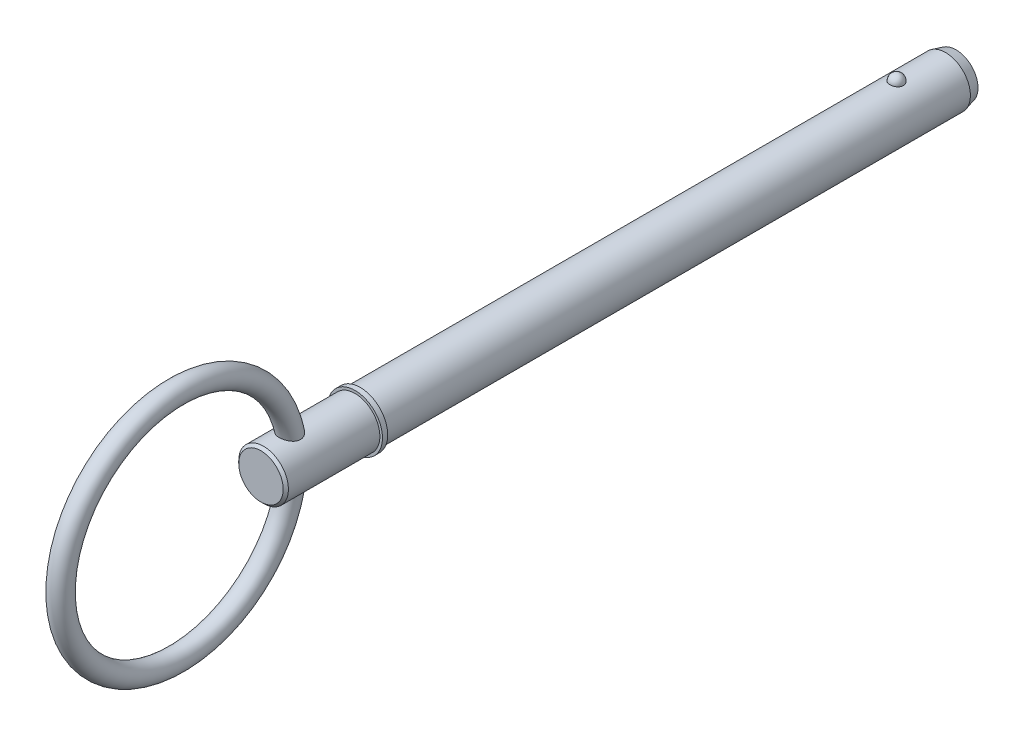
from build123d import *

# Parameters (mm, degrees)
SKETCH2_R           = 4.765
BOSS_EXTRUDE1_DEPTH = 101.6
BOSS_EXTRUDE2_START = 12.7
SKETCH3_R           = 4.765
BOSS_EXTRUDE2_DEPTH = 12.7
CHAMFER1_SIZE       = 2
CHAMFER1_SIZE2      = 0.535898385
SKETCH20_W          = 1
SKETCH20_H          = 5.265
SKETCH21_R          = 4.765
BOSS_EXTRUDE3_DEPTH = 19.05
CHAMFER2_SIZE       = 0.5
SKETCH24_R          = 2


with BuildPart() as part:
    # Sketch2 → Boss-Extrude1 (new body)
    with BuildSketch(Plane.XY):
        Circle(SKETCH2_R)
    extrude(amount=BOSS_EXTRUDE1_DEPTH)

    # Sketch3 → Boss-Extrude2 (add)
    with BuildSketch(Plane(origin=(0, 0, 0), x_dir=(-1, 0, 0), z_dir=(0, 0, -1)).offset(BOSS_EXTRUDE2_START)):
        Circle(SKETCH3_R)
    extrude(amount=-BOSS_EXTRUDE2_DEPTH)

    # Chamfer1
    chamfer1_edges = [part.edges().sort_by_distance(p)[0] for p in [
        (4.765, 0, -12.7),
    ]]
    chamfer1_side = [part.faces().sort_by_distance(p)[0] for p in [
        (4.765, 0, -6.35),
    ]]
    chamfer(chamfer1_edges, length=CHAMFER1_SIZE, length2=CHAMFER1_SIZE2, reference=chamfer1_side[0])

    # Sketch18 → Revolve1 (revolve)
    with BuildSketch(Plane(origin=(0, 0, 0), x_dir=(0, 0, -1), z_dir=(1, 0, 0))):
        with BuildLine():
            Line((1.29, 6.055), (1.29, 3.475))
            ThreePointArc((1.29, 3.475), (0, 4.765), (1.29, 6.055))
        make_face()
    revolve(axis=Axis((0, 6.055, -1.29), (0, -1, 0)))

    # Sketch20 → Revolve2 (revolve)
    with BuildSketch(Plane(origin=(0, 0, 0), x_dir=(0, 0, -1), z_dir=(1, 0, 0)), mode=Mode.PRIVATE) as revolve2_sk:
        with Locations((-102.1, 2.6325)):
            Rectangle(SKETCH20_W, SKETCH20_H)
    revolve(revolve2_sk.sketch.rotate(Axis((0, 0, 33.728787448), (0, 0, 1)), 90), axis=Axis((0, 0, 33.728787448), (0, 0, 1)))

    # Sketch21 → Boss-Extrude3 (add)
    with BuildSketch(Plane(origin=(0, 0, 101.6), x_dir=(-1, 0, 0), z_dir=(0, 0, -1))):
        Circle(SKETCH21_R)
    extrude(amount=-BOSS_EXTRUDE3_DEPTH)

    # Chamfer2
    chamfer2_edges = [part.edges().sort_by_distance(p)[0] for p in [
        (4.765, 0, 120.65),
    ]]
    chamfer(chamfer2_edges, length=CHAMFER2_SIZE)

    # Sweep1: sweep along a path in Sketch23
    with BuildLine(Plane(origin=(0, 0, 0), x_dir=(0, 0, -1), z_dir=(1, 0, 0))) as sweep1_path:
        CenterArc((-136.875, 0), 22.225, 0, 360)
    # Sketch24 → Sweep1 (sweep)
    with BuildSketch(Plane(origin=(0, 0, 0), x_dir=(1, 0, 0), z_dir=(0, 1, 0))):
        with Locations((0, -114.65)):
            Circle(SKETCH24_R)
    sweep(path=sweep1_path.line)


solid = part.part
